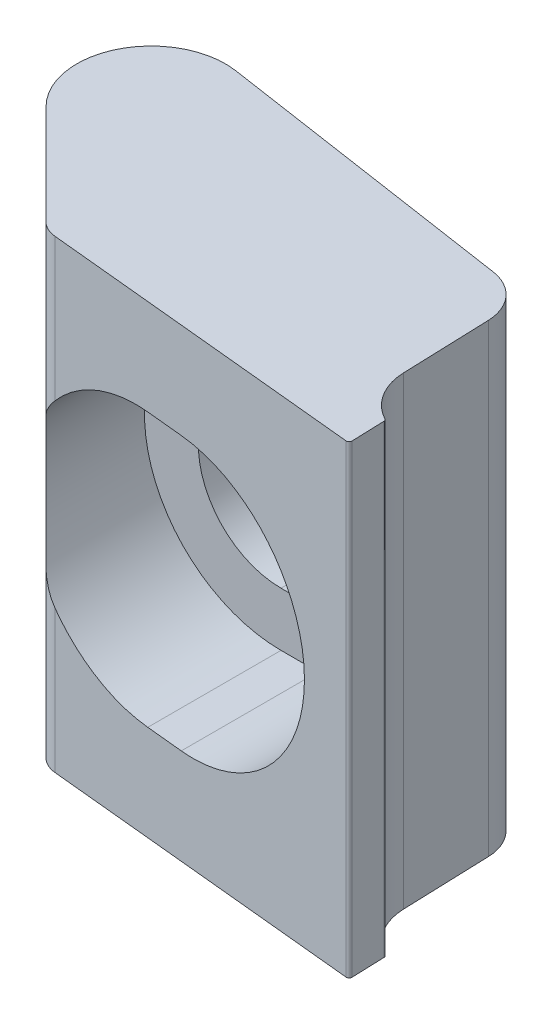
ISO-10303-21;
HEADER;
FILE_DESCRIPTION(('STEP AP214'),'2;1');
FILE_NAME('part.step','',(''),(''),'','','');
FILE_SCHEMA(('AUTOMOTIVE_DESIGN { 1 0 10303 214 1 1 1 1 }'));
ENDSEC;
DATA;
#1=APPLICATION_CONTEXT('core data for automotive mechanical design processes');
#2=APPLICATION_PROTOCOL_DEFINITION('international standard','automotive_design',2000,#1);
#3=PRODUCT_CONTEXT('',#1,'mechanical');
#4=PRODUCT('Part','Part','',(#3));
#5=PRODUCT_RELATED_PRODUCT_CATEGORY('part','',(#4));
#6=PRODUCT_DEFINITION_FORMATION('','',#4);
#7=PRODUCT_DEFINITION_CONTEXT('part definition',#1,'design');
#8=PRODUCT_DEFINITION('design','',#6,#7);
#9=PRODUCT_DEFINITION_SHAPE('','',#8);
#10=(LENGTH_UNIT() NAMED_UNIT(*) SI_UNIT(.MILLI.,.METRE.));
#11=(NAMED_UNIT(*) PLANE_ANGLE_UNIT() SI_UNIT($,.RADIAN.));
#12=(NAMED_UNIT(*) SI_UNIT($,.STERADIAN.) SOLID_ANGLE_UNIT());
#13=UNCERTAINTY_MEASURE_WITH_UNIT(LENGTH_MEASURE(1.E-05),#10,'distance_accuracy_value','');
#14=(GEOMETRIC_REPRESENTATION_CONTEXT(3) GLOBAL_UNCERTAINTY_ASSIGNED_CONTEXT((#13)) GLOBAL_UNIT_ASSIGNED_CONTEXT((#10,
#11,#12)) REPRESENTATION_CONTEXT('',''));
#15=CARTESIAN_POINT('',(0.,0.,0.));
#16=DIRECTION('',(0.,0.,1.));
#17=DIRECTION('',(1.,0.,0.));
#18=AXIS2_PLACEMENT_3D('',#15,#16,#17);
#19=CARTESIAN_POINT('',(-5.63321148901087,9.525,8.4857853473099));
#20=DIRECTION('',(0.,-1.,0.));
#21=DIRECTION('',(1.,0.,0.));
#22=AXIS2_PLACEMENT_3D('',#19,#20,#21);
#23=CYLINDRICAL_SURFACE('',#22,1.143);
#24=DIRECTION('',(0.,-1.,0.));
#25=VECTOR('',#24,1.);
#26=CARTESIAN_POINT('',(-6.44143453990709,9.525,9.29400839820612));
#27=LINE('',#26,#25);
#28=CARTESIAN_POINT('',(-6.44143453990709,9.525,9.29400839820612));
#29=VERTEX_POINT('',#28);
#30=CARTESIAN_POINT('',(-6.44143453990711,2.68079802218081,9.29400839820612));
#31=VERTEX_POINT('',#30);
#32=EDGE_CURVE('E327',#29,#31,#27,.T.);
#33=ORIENTED_EDGE('',*,*,#32,.T.);
#34=CARTESIAN_POINT('',(-4.49021148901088,4.75072940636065,8.4857853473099));
#35=CARTESIAN_POINT('',(-4.49021469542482,4.75072833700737,8.42949001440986));
#36=CARTESIAN_POINT('',(-4.49439454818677,4.74812553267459,8.3731533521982));
#37=CARTESIAN_POINT('',(-4.51089792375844,4.73776021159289,8.26213643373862));
#38=CARTESIAN_POINT('',(-4.52323094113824,4.72999167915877,8.20745818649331));
#39=CARTESIAN_POINT('',(-4.55533502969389,4.7094805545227,8.10148309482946));
#40=CARTESIAN_POINT('',(-4.57508705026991,4.6967506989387,8.05017798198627));
#41=CARTESIAN_POINT('',(-4.62102342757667,4.66658735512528,7.95206193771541));
#42=CARTESIAN_POINT('',(-4.64720715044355,4.6491543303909,7.90525056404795));
#43=CARTESIAN_POINT('',(-4.70591191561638,4.60918444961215,7.81529323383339));
#44=CARTESIAN_POINT('',(-4.73863845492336,4.58647665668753,7.77235832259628));
#45=CARTESIAN_POINT('',(-4.80830188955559,4.53685258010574,7.69283410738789));
#46=CARTESIAN_POINT('',(-4.8452401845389,4.50993489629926,7.65624692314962));
#47=CARTESIAN_POINT('',(-4.9269283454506,4.44868974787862,7.58528258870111));
#48=CARTESIAN_POINT('',(-4.97207122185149,4.41385436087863,7.55179932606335));
#49=CARTESIAN_POINT('',(-5.06431471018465,4.34022035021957,7.49290736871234));
#50=CARTESIAN_POINT('',(-5.11141662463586,4.30141906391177,7.46750414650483));
#51=CARTESIAN_POINT('',(-5.23147826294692,4.19898852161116,7.41273697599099));
#52=CARTESIAN_POINT('',(-5.30486740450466,4.13312974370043,7.38845180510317));
#53=CARTESIAN_POINT('',(-5.44979945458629,3.995747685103,7.35513734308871));
#54=CARTESIAN_POINT('',(-5.5213376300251,3.92421148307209,7.34614396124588));
#55=CARTESIAN_POINT('',(-5.6881100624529,3.74805667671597,7.33997003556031));
#56=CARTESIAN_POINT('',(-5.78153990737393,3.64153383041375,7.34886026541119));
#57=CARTESIAN_POINT('',(-5.95848782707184,3.4238759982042,7.38630827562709));
#58=CARTESIAN_POINT('',(-6.04199262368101,3.31273509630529,7.41489206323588));
#59=CARTESIAN_POINT('',(-6.16039883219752,3.14271287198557,7.47064964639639));
#60=CARTESIAN_POINT('',(-6.19928710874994,3.08453155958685,7.49182979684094));
#61=CARTESIAN_POINT('',(-6.27413970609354,2.96796307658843,7.5383656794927));
#62=CARTESIAN_POINT('',(-6.31010466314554,2.90957595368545,7.56372049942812));
#63=CARTESIAN_POINT('',(-6.37910161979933,2.7929237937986,7.61858116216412));
#64=CARTESIAN_POINT('',(-6.41213062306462,2.73465893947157,7.64809116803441));
#65=CARTESIAN_POINT('',(-6.47512508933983,2.61888278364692,7.71143199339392));
#66=CARTESIAN_POINT('',(-6.50509223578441,2.56137108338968,7.74526041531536));
#67=CARTESIAN_POINT('',(-6.56638912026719,2.43875650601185,7.8235915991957));
#68=CARTESIAN_POINT('',(-6.59717682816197,2.37390200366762,7.86893635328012));
#69=CARTESIAN_POINT('',(-6.63964580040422,2.28017353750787,7.94325437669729));
#70=CARTESIAN_POINT('',(-6.65315959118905,2.24958163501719,7.96901837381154));
#71=CARTESIAN_POINT('',(-6.67881238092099,2.19015737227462,8.02311199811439));
#72=CARTESIAN_POINT('',(-6.69095288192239,2.16132310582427,8.05143875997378));
#73=CARTESIAN_POINT('',(-6.71077901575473,2.11321201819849,8.10385033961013));
#74=CARTESIAN_POINT('',(-6.71882286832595,2.09333806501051,8.12724558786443));
#75=CARTESIAN_POINT('',(-6.7337834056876,2.0558221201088,8.17619443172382));
#76=CARTESIAN_POINT('',(-6.74069839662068,2.03818349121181,8.20175118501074));
#77=CARTESIAN_POINT('',(-6.75314803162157,2.00602896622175,8.25563964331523));
#78=CARTESIAN_POINT('',(-6.75866201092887,1.99156021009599,8.28400516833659));
#79=CARTESIAN_POINT('',(-6.76765888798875,1.96775198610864,8.34309859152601));
#80=CARTESIAN_POINT('',(-6.77114994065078,1.95839193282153,8.37381643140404));
#81=CARTESIAN_POINT('',(-6.77495968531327,1.94814870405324,8.42774084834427));
#82=CARTESIAN_POINT('',(-6.77589966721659,1.94560795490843,8.45058690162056));
#83=CARTESIAN_POINT('',(-6.77639118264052,1.94428095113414,8.49640589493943));
#84=CARTESIAN_POINT('',(-6.77594303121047,1.94549384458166,8.5193788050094));
#85=CARTESIAN_POINT('',(-6.77371059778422,1.95150923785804,8.56468096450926));
#86=CARTESIAN_POINT('',(-6.77193112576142,1.95629881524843,8.58701223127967));
#87=CARTESIAN_POINT('',(-6.76720615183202,1.96892736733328,8.63065948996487));
#88=CARTESIAN_POINT('',(-6.76425949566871,1.97676936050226,8.65197445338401));
#89=CARTESIAN_POINT('',(-6.75514560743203,2.00080201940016,8.70697018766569));
#90=CARTESIAN_POINT('',(-6.74813407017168,2.01909369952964,8.73958211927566));
#91=CARTESIAN_POINT('',(-6.73219451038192,2.05986233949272,8.80156563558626));
#92=CARTESIAN_POINT('',(-6.72325966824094,2.08235415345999,8.83092511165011));
#93=CARTESIAN_POINT('',(-6.70376213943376,2.13039655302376,8.88737774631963));
#94=CARTESIAN_POINT('',(-6.69317265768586,2.15599557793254,8.9144196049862));
#95=CARTESIAN_POINT('',(-6.670752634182,2.20898407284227,8.96615056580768));
#96=CARTESIAN_POINT('',(-6.65892079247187,2.2363754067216,8.99083715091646));
#97=CARTESIAN_POINT('',(-6.621767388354,2.32041919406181,9.06206003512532));
#98=CARTESIAN_POINT('',(-6.59482686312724,2.37884384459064,9.10565429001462));
#99=CARTESIAN_POINT('',(-6.53604153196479,2.50041196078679,9.1886569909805));
#100=CARTESIAN_POINT('',(-6.50403556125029,2.56365029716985,9.22780455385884));
#101=CARTESIAN_POINT('',(-6.43623617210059,2.69128280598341,9.3006946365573));
#102=CARTESIAN_POINT('',(-6.40043930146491,2.75567798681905,9.33443215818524));
#103=CARTESIAN_POINT('',(-6.32518499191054,2.88479628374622,9.39683382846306));
#104=CARTESIAN_POINT('',(-6.28572706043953,2.94951944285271,9.42549729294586));
#105=CARTESIAN_POINT('',(-6.20321759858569,3.07874116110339,9.4777143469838));
#106=CARTESIAN_POINT('',(-6.16016532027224,3.14323967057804,9.50126686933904));
#107=CARTESIAN_POINT('',(-6.03710812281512,3.31938624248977,9.55852949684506));
#108=CARTESIAN_POINT('',(-5.95346329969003,3.43037193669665,9.58673960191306));
#109=CARTESIAN_POINT('',(-5.77637875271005,3.64755014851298,9.62336608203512));
#110=CARTESIAN_POINT('',(-5.68296439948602,3.75375410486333,9.63183245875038));
#111=CARTESIAN_POINT('',(-5.51919097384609,3.92628603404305,9.62503834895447));
#112=CARTESIAN_POINT('',(-5.4507621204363,3.99469439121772,9.61637222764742));
#113=CARTESIAN_POINT('',(-5.31211391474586,4.12639234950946,9.585049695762));
#114=CARTESIAN_POINT('',(-5.24189669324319,4.18968769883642,9.56240925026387));
#115=CARTESIAN_POINT('',(-5.11714942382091,4.29679110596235,9.50742685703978));
#116=CARTESIAN_POINT('',(-5.06241466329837,4.34190375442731,9.47811092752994));
#117=CARTESIAN_POINT('',(-4.95572646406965,4.4267047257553,9.40855466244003));
#118=CARTESIAN_POINT('',(-4.90376966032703,4.46639970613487,9.36832791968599));
#119=CARTESIAN_POINT('',(-4.81354641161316,4.53313823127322,9.28437004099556));
#120=CARTESIAN_POINT('',(-4.77444211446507,4.56118760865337,9.24234330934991));
#121=CARTESIAN_POINT('',(-4.70181412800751,4.61208245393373,9.15088102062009));
#122=CARTESIAN_POINT('',(-4.6682905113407,4.63492785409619,9.10144536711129));
#123=CARTESIAN_POINT('',(-4.6084950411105,4.67493748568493,8.99579804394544));
#124=CARTESIAN_POINT('',(-4.58226962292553,4.69206547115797,8.93954611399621));
#125=CARTESIAN_POINT('',(-4.53905343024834,4.719953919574,8.82217796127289));
#126=CARTESIAN_POINT('',(-4.52204580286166,4.73072600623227,8.76107085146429));
#127=CARTESIAN_POINT('',(-4.5035867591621,4.74235789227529,8.6637390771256));
#128=CARTESIAN_POINT('',(-4.4985829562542,4.74549386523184,8.62841295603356));
#129=CARTESIAN_POINT('',(-4.49189443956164,4.74967987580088,8.55732521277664));
#130=CARTESIAN_POINT('',(-4.490209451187,4.75073008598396,8.52156362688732));
#131=CARTESIAN_POINT('',(-4.49021148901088,4.75072940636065,8.4857853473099));
#132=B_SPLINE_CURVE_WITH_KNOTS('',3,(#34,#35,#36,#37,#38,#39,#40,#41,#42,#43,#44,#45,#46,#47,
#48,#49,#50,#51,#52,#53,#54,#55,#56,#57,#58,#59,#60,#61,#62,#63,#64,#65,#66,#67,#68,#69,#70,#71,
#72,#73,#74,#75,#76,#77,#78,#79,#80,#81,#82,#83,#84,#85,#86,#87,#88,#89,#90,#91,#92,#93,#94,#95,
#96,#97,#98,#99,#100,#101,#102,#103,#104,#105,#106,#107,#108,#109,#110,#111,#112,#113,#114,#115,
#116,#117,#118,#119,#120,#121,#122,#123,#124,#125,#126,#127,#128,#129,#130,#131),.UNSPECIFIED.,
.T.,.F.,(4,2,2,2,2,2,2,2,2,2,2,2,2,2,2,2,2,2,2,2,2,2,2,2,2,2,2,2,2,2,2,2,2,2,2,2,2,2,2,2,2,2,2,
2,2,2,2,2,4),(0.,0.168746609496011,0.33769007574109,0.50620266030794,0.674698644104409,
0.849694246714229,1.02474817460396,1.22238324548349,1.42015188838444,1.72310054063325,
2.02675962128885,2.45038828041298,2.8745774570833,3.09377987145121,3.31293444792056,
3.53231017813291,3.75156463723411,4.00570961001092,4.13226772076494,4.25868604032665,
4.35376083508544,4.44897700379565,4.54552526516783,4.64168155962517,4.71037401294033,
4.77905087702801,4.84748080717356,4.9159785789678,5.02944692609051,5.14332443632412,
5.25928570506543,5.37536954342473,5.60797929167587,5.85059968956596,6.09344296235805,
6.33631895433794,6.57924561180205,7.00310547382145,7.42589072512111,7.71640614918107,
8.00659028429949,8.2359829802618,8.46509119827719,8.65597505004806,8.84686138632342,
9.03893584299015,9.23065793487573,9.33791305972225,9.44515931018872),.UNSPECIFIED.);
#133=CARTESIAN_POINT('',(-5.74474874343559,3.68145630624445,9.62333026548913));
#134=VERTEX_POINT('',#133);
#135=EDGE_CURVE('E212',#31,#134,#132,.T.);
#136=ORIENTED_EDGE('',*,*,#135,.T.);
#137=DIRECTION('',(0.,-1.,0.));
#138=VECTOR('',#137,1.);
#139=CARTESIAN_POINT('',(-5.74474874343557,9.525,9.62333026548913));
#140=LINE('',#139,#138);
#141=CARTESIAN_POINT('',(-5.74474874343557,9.525,9.62333026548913));
#142=VERTEX_POINT('',#141);
#143=EDGE_CURVE('E323',#142,#134,#140,.T.);
#144=ORIENTED_EDGE('',*,*,#143,.F.);
#145=CARTESIAN_POINT('',(-5.63321148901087,9.525,8.4857853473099));
#146=DIRECTION('',(0.,1.,0.));
#147=DIRECTION('',(1.,0.,0.));
#148=AXIS2_PLACEMENT_3D('',#145,#146,#147);
#149=CIRCLE('',#148,1.143);
#150=EDGE_CURVE('E280',#29,#142,#149,.T.);
#151=ORIENTED_EDGE('',*,*,#150,.F.);
#152=EDGE_LOOP('',(#33,#136,#144,#151));
#153=FACE_BOUND('',#152,.T.);
#154=ADVANCED_FACE('F16',(#153),#23,.T.);
#155=CARTESIAN_POINT('',(-8.37692,9.525,3.048));
#156=DIRECTION('',(0.,-1.,0.));
#157=DIRECTION('',(1.,0.,0.));
#158=AXIS2_PLACEMENT_3D('',#155,#156,#157);
#159=CYLINDRICAL_SURFACE('',#158,3.048);
#160=CARTESIAN_POINT('',(-8.37692,-9.525,3.048));
#161=DIRECTION('',(0.,1.,0.));
#162=DIRECTION('',(-1.,0.,0.));
#163=AXIS2_PLACEMENT_3D('',#160,#161,#162);
#164=CIRCLE('',#163,3.048);
#165=CARTESIAN_POINT('',(-7.92431353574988,-9.525,0.0337917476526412));
#166=VERTEX_POINT('',#165);
#167=CARTESIAN_POINT('',(-10.5321814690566,-9.525,5.20326146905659));
#168=VERTEX_POINT('',#167);
#169=EDGE_CURVE('E250',#166,#168,#164,.T.);
#170=ORIENTED_EDGE('',*,*,#169,.T.);
#171=DIRECTION('',(0.,-1.,0.));
#172=VECTOR('',#171,1.);
#173=CARTESIAN_POINT('',(-10.5321814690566,9.525,5.20326146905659));
#174=LINE('',#173,#172);
#175=CARTESIAN_POINT('',(-10.5321814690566,9.525,5.20326146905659));
#176=VERTEX_POINT('',#175);
#177=EDGE_CURVE('E330',#176,#168,#174,.T.);
#178=ORIENTED_EDGE('',*,*,#177,.F.);
#179=CARTESIAN_POINT('',(-8.37692,9.525,3.048));
#180=DIRECTION('',(0.,1.,0.));
#181=DIRECTION('',(-1.,0.,0.));
#182=AXIS2_PLACEMENT_3D('',#179,#180,#181);
#183=CIRCLE('',#182,3.048);
#184=CARTESIAN_POINT('',(-7.92431353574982,9.525,0.0337917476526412));
#185=VERTEX_POINT('',#184);
#186=EDGE_CURVE('E275',#185,#176,#183,.T.);
#187=ORIENTED_EDGE('',*,*,#186,.F.);
#188=DIRECTION('',(0.,-1.,0.));
#189=VECTOR('',#188,1.);
#190=CARTESIAN_POINT('',(-7.92431353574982,9.525,0.0337917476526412));
#191=LINE('',#190,#189);
#192=EDGE_CURVE('E298',#185,#166,#191,.T.);
#193=ORIENTED_EDGE('',*,*,#192,.T.);
#194=EDGE_LOOP('',(#170,#178,#187,#193));
#195=FACE_BOUND('',#194,.T.);
#196=ADVANCED_FACE('F18',(#195),#159,.T.);
#197=CARTESIAN_POINT('',(-6.44143453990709,9.525,9.29400839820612));
#198=DIRECTION('',(0.707106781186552,0.,-0.707106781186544));
#199=DIRECTION('',(-0.707106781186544,0.,-0.707106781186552));
#200=AXIS2_PLACEMENT_3D('',#197,#198,#199);
#201=PLANE('',#200);
#202=CARTESIAN_POINT('',(-6.44143453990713,-2.68079802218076,9.29400839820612));
#203=VERTEX_POINT('',#202);
#204=CARTESIAN_POINT('',(-6.44143453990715,-9.525,9.29400839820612));
#205=VERTEX_POINT('',#204);
#206=EDGE_CURVE('E326',#203,#205,#27,.T.);
#207=ORIENTED_EDGE('',*,*,#206,.F.);
#208=CARTESIAN_POINT('',(-1.524,0.,14.2114429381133));
#209=DIRECTION('',(0.707106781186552,0.,-0.707106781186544));
#210=DIRECTION('',(0.707106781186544,0.,0.707106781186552));
#211=AXIS2_PLACEMENT_3D('',#208,#209,#210);
#212=ELLIPSE('',#211,7.92058589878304,5.6007);
#213=EDGE_CURVE('E227',#203,#31,#212,.T.);
#214=ORIENTED_EDGE('',*,*,#213,.T.);
#215=ORIENTED_EDGE('',*,*,#32,.F.);
#216=DIRECTION('',(0.707106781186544,0.,0.707106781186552));
#217=VECTOR('',#216,1.);
#218=CARTESIAN_POINT('',(-6.44143453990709,9.525,9.29400839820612));
#219=LINE('',#218,#217);
#220=EDGE_CURVE('E278',#176,#29,#219,.T.);
#221=ORIENTED_EDGE('',*,*,#220,.F.);
#222=ORIENTED_EDGE('',*,*,#177,.T.);
#223=DIRECTION('',(0.707106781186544,0.,0.707106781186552));
#224=VECTOR('',#223,1.);
#225=CARTESIAN_POINT('',(-6.44143453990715,-9.525,9.29400839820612));
#226=LINE('',#225,#224);
#227=EDGE_CURVE('E253',#168,#205,#226,.T.);
#228=ORIENTED_EDGE('',*,*,#227,.T.);
#229=EDGE_LOOP('',(#207,#214,#215,#221,#222,#228));
#230=FACE_BOUND('',#229,.T.);
#231=ADVANCED_FACE('F352',(#230),#201,.F.);
#232=CARTESIAN_POINT('',(-5.74474874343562,-3.6814563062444,9.62333026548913));
#233=VERTEX_POINT('',#232);
#234=CARTESIAN_POINT('',(-5.74474874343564,-9.525,9.62333026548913));
#235=VERTEX_POINT('',#234);
#236=EDGE_CURVE('E322',#233,#235,#140,.T.);
#237=ORIENTED_EDGE('',*,*,#236,.F.);
#238=CARTESIAN_POINT('',(-4.49021148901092,-4.75072940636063,8.4857853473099));
#239=CARTESIAN_POINT('',(-4.49021469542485,-4.75072833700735,8.54208068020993));
#240=CARTESIAN_POINT('',(-4.49439454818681,-4.74812553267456,8.59841734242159));
#241=CARTESIAN_POINT('',(-4.51089792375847,-4.73776021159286,8.70943426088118));
#242=CARTESIAN_POINT('',(-4.52323094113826,-4.72999167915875,8.76411250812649));
#243=CARTESIAN_POINT('',(-4.55533502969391,-4.70948055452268,8.87008759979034));
#244=CARTESIAN_POINT('',(-4.57508705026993,-4.69675069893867,8.92139271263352));
#245=CARTESIAN_POINT('',(-4.6210234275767,-4.66658735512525,9.01950875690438));
#246=CARTESIAN_POINT('',(-4.64720715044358,-4.64915433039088,9.06632013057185));
#247=CARTESIAN_POINT('',(-4.70591191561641,-4.60918444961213,9.15627746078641));
#248=CARTESIAN_POINT('',(-4.73863845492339,-4.58647665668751,9.19921237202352));
#249=CARTESIAN_POINT('',(-4.80830188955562,-4.5368525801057,9.2787365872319));
#250=CARTESIAN_POINT('',(-4.84524018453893,-4.50993489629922,9.31532377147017));
#251=CARTESIAN_POINT('',(-4.92692834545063,-4.44868974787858,9.38628810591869));
#252=CARTESIAN_POINT('',(-4.97207122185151,-4.4138543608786,9.41977136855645));
#253=CARTESIAN_POINT('',(-5.06431471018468,-4.34022035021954,9.47866332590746));
#254=CARTESIAN_POINT('',(-5.1114166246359,-4.30141906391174,9.50406654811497));
#255=CARTESIAN_POINT('',(-5.23147826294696,-4.19898852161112,9.55883371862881));
#256=CARTESIAN_POINT('',(-5.30486740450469,-4.13312974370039,9.58311888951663));
#257=CARTESIAN_POINT('',(-5.44979945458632,-3.99574768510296,9.61643335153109));
#258=CARTESIAN_POINT('',(-5.52133763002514,-3.92421148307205,9.62542673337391));
#259=CARTESIAN_POINT('',(-5.68811006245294,-3.74805667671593,9.63160065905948));
#260=CARTESIAN_POINT('',(-5.78153990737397,-3.6415338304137,9.6227104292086));
#261=CARTESIAN_POINT('',(-5.95848782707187,-3.42387599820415,9.58526241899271));
#262=CARTESIAN_POINT('',(-6.04199262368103,-3.31273509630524,9.55667863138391));
#263=CARTESIAN_POINT('',(-6.16039883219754,-3.14271287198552,9.5009210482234));
#264=CARTESIAN_POINT('',(-6.19928710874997,-3.0845315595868,9.47974089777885));
#265=CARTESIAN_POINT('',(-6.27413970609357,-2.96796307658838,9.43320501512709));
#266=CARTESIAN_POINT('',(-6.31010466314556,-2.9095759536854,9.40785019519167));
#267=CARTESIAN_POINT('',(-6.37910161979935,-2.79292379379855,9.35298953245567));
#268=CARTESIAN_POINT('',(-6.41213062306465,-2.73465893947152,9.32347952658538));
#269=CARTESIAN_POINT('',(-6.47512508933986,-2.61888278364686,9.26013870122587));
#270=CARTESIAN_POINT('',(-6.50509223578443,-2.56137108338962,9.22631027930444));
#271=CARTESIAN_POINT('',(-6.56638912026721,-2.43875650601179,9.14797909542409));
#272=CARTESIAN_POINT('',(-6.597176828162,-2.37390200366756,9.10263434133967));
#273=CARTESIAN_POINT('',(-6.63964580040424,-2.28017353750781,9.02831631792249));
#274=CARTESIAN_POINT('',(-6.65315959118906,-2.24958163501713,9.00255232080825));
#275=CARTESIAN_POINT('',(-6.67881238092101,-2.19015737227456,8.94845869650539));
#276=CARTESIAN_POINT('',(-6.69095288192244,-2.16132310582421,8.920131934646));
#277=CARTESIAN_POINT('',(-6.71077901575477,-2.11321201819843,8.86772035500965));
#278=CARTESIAN_POINT('',(-6.71882286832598,-2.09333806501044,8.84432510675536));
#279=CARTESIAN_POINT('',(-6.73378340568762,-2.05582212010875,8.79537626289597));
#280=CARTESIAN_POINT('',(-6.7406983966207,-2.03818349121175,8.76981950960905));
#281=CARTESIAN_POINT('',(-6.75314803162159,-2.0060289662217,8.71593105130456));
#282=CARTESIAN_POINT('',(-6.75866201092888,-1.99156021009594,8.68756552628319));
#283=CARTESIAN_POINT('',(-6.76765888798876,-1.96775198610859,8.62847210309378));
#284=CARTESIAN_POINT('',(-6.77114994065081,-1.95839193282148,8.59775426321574));
#285=CARTESIAN_POINT('',(-6.77495968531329,-1.94814870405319,8.54382984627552));
#286=CARTESIAN_POINT('',(-6.77589966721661,-1.94560795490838,8.52098379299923));
#287=CARTESIAN_POINT('',(-6.77639118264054,-1.94428095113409,8.47516479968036));
#288=CARTESIAN_POINT('',(-6.77594303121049,-1.94549384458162,8.45219188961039));
#289=CARTESIAN_POINT('',(-6.77371059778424,-1.951509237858,8.40688973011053));
#290=CARTESIAN_POINT('',(-6.77193112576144,-1.95629881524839,8.38455846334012));
#291=CARTESIAN_POINT('',(-6.76720615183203,-1.96892736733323,8.34091120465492));
#292=CARTESIAN_POINT('',(-6.76425949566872,-1.97676936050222,8.31959624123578));
#293=CARTESIAN_POINT('',(-6.75514560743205,-2.00080201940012,8.2646005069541));
#294=CARTESIAN_POINT('',(-6.7481340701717,-2.0190936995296,8.23198857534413));
#295=CARTESIAN_POINT('',(-6.73219451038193,-2.05986233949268,8.17000505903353));
#296=CARTESIAN_POINT('',(-6.72325966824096,-2.08235415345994,8.14064558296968));
#297=CARTESIAN_POINT('',(-6.70376213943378,-2.13039655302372,8.08419294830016));
#298=CARTESIAN_POINT('',(-6.69317265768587,-2.1559955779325,8.05715108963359));
#299=CARTESIAN_POINT('',(-6.67075263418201,-2.20898407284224,8.00542012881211));
#300=CARTESIAN_POINT('',(-6.65892079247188,-2.23637540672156,7.98073354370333));
#301=CARTESIAN_POINT('',(-6.62176738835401,-2.32041919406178,7.90951065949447));
#302=CARTESIAN_POINT('',(-6.59482686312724,-2.3788438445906,7.86591640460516));
#303=CARTESIAN_POINT('',(-6.53604153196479,-2.50041196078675,7.78291370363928));
#304=CARTESIAN_POINT('',(-6.5040355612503,-2.56365029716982,7.74376614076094));
#305=CARTESIAN_POINT('',(-6.4362361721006,-2.69128280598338,7.6708760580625));
#306=CARTESIAN_POINT('',(-6.40043930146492,-2.75567798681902,7.63713853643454));
#307=CARTESIAN_POINT('',(-6.32518499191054,-2.88479628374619,7.57473686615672));
#308=CARTESIAN_POINT('',(-6.28572706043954,-2.94951944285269,7.54607340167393));
#309=CARTESIAN_POINT('',(-6.2032175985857,-3.07874116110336,7.49385634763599));
#310=CARTESIAN_POINT('',(-6.16016532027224,-3.14323967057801,7.47030382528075));
#311=CARTESIAN_POINT('',(-6.03710812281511,-3.31938624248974,7.41304119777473));
#312=CARTESIAN_POINT('',(-5.95346329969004,-3.43037193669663,7.38483109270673));
#313=CARTESIAN_POINT('',(-5.77637875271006,-3.64755014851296,7.34820461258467));
#314=CARTESIAN_POINT('',(-5.68296439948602,-3.7537541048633,7.3397382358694));
#315=CARTESIAN_POINT('',(-5.51919097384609,-3.92628603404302,7.34653234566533));
#316=CARTESIAN_POINT('',(-5.45076212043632,-3.99469439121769,7.35519846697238));
#317=CARTESIAN_POINT('',(-5.31211391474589,-4.12639234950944,7.3865209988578));
#318=CARTESIAN_POINT('',(-5.24189669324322,-4.18968769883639,7.40916144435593));
#319=CARTESIAN_POINT('',(-5.11714942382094,-4.29679110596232,7.46414383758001));
#320=CARTESIAN_POINT('',(-5.06241466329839,-4.34190375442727,7.49345976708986));
#321=CARTESIAN_POINT('',(-4.95572646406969,-4.42670472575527,7.56301603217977));
#322=CARTESIAN_POINT('',(-4.90376966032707,-4.46639970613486,7.60324277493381));
#323=CARTESIAN_POINT('',(-4.8135464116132,-4.53313823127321,7.68720065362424));
#324=CARTESIAN_POINT('',(-4.7744421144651,-4.56118760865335,7.72922738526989));
#325=CARTESIAN_POINT('',(-4.70181412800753,-4.6120824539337,7.82068967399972));
#326=CARTESIAN_POINT('',(-4.66829051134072,-4.63492785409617,7.87012532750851));
#327=CARTESIAN_POINT('',(-4.60849504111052,-4.67493748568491,7.97577265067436));
#328=CARTESIAN_POINT('',(-4.58226962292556,-4.69206547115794,8.03202458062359));
#329=CARTESIAN_POINT('',(-4.53905343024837,-4.71995391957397,8.14939273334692));
#330=CARTESIAN_POINT('',(-4.52204580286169,-4.73072600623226,8.21049984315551));
#331=CARTESIAN_POINT('',(-4.50358675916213,-4.74235789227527,8.3078316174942));
#332=CARTESIAN_POINT('',(-4.49858295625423,-4.74549386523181,8.34315773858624));
#333=CARTESIAN_POINT('',(-4.49189443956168,-4.74967987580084,8.41424548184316));
#334=CARTESIAN_POINT('',(-4.49020945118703,-4.75073008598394,8.45000706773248));
#335=CARTESIAN_POINT('',(-4.49021148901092,-4.75072940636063,8.4857853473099));
#336=B_SPLINE_CURVE_WITH_KNOTS('',3,(#238,#239,#240,#241,#242,#243,#244,#245,#246,#247,#248,
#249,#250,#251,#252,#253,#254,#255,#256,#257,#258,#259,#260,#261,#262,#263,#264,#265,#266,#267,
#268,#269,#270,#271,#272,#273,#274,#275,#276,#277,#278,#279,#280,#281,#282,#283,#284,#285,#286,
#287,#288,#289,#290,#291,#292,#293,#294,#295,#296,#297,#298,#299,#300,#301,#302,#303,#304,#305,
#306,#307,#308,#309,#310,#311,#312,#313,#314,#315,#316,#317,#318,#319,#320,#321,#322,#323,#324,
#325,#326,#327,#328,#329,#330,#331,#332,#333,#334,#335),.UNSPECIFIED.,.T.,.F.,(4,2,2,2,2,2,2,2,
2,2,2,2,2,2,2,2,2,2,2,2,2,2,2,2,2,2,2,2,2,2,2,2,2,2,2,2,2,2,2,2,2,2,2,2,2,2,2,2,4),(0.,
0.168746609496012,0.337690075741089,0.506202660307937,0.674698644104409,0.849694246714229,
1.02474817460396,1.22238324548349,1.42015188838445,1.72310054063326,2.02675962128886,
2.45038828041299,2.87457745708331,3.09377987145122,3.31293444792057,3.53231017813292,
3.75156463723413,4.00570961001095,4.13226772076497,4.25868604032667,4.35376083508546,
4.44897700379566,4.54552526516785,4.64168155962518,4.71037401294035,4.77905087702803,
4.84748080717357,4.91597857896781,5.02944692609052,5.14332443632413,5.25928570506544,
5.37536954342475,5.6079792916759,5.85059968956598,6.09344296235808,6.33631895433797,
6.57924561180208,7.00310547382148,7.42589072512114,7.71640614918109,8.00659028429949,
8.23598298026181,8.4650911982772,8.65597505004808,8.84686138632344,9.03893584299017,
9.23065793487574,9.33791305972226,9.44515931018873),.UNSPECIFIED.);
#337=EDGE_CURVE('E244',#233,#203,#336,.T.);
#338=ORIENTED_EDGE('',*,*,#337,.T.);
#339=ORIENTED_EDGE('',*,*,#206,.T.);
#340=CARTESIAN_POINT('',(-5.63321148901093,-9.525,8.4857853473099));
#341=DIRECTION('',(0.,1.,0.));
#342=DIRECTION('',(1.,0.,0.));
#343=AXIS2_PLACEMENT_3D('',#340,#341,#342);
#344=CIRCLE('',#343,1.143);
#345=EDGE_CURVE('E256',#205,#235,#344,.T.);
#346=ORIENTED_EDGE('',*,*,#345,.T.);
#347=EDGE_LOOP('',(#237,#338,#339,#346));
#348=FACE_BOUND('',#347,.T.);
#349=ADVANCED_FACE('F229',(#348),#23,.T.);
#350=CARTESIAN_POINT('',(7.49454627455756,9.525,10.9214544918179));
#351=DIRECTION('',(0.0975828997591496,0.,-0.995227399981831));
#352=DIRECTION('',(-0.995227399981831,0.,-0.0975828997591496));
#353=AXIS2_PLACEMENT_3D('',#350,#351,#352);
#354=PLANE('',#353);
#355=DIRECTION('',(-0.995227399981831,0.,-0.0975828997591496));
#356=VECTOR('',#355,1.);
#357=CARTESIAN_POINT('',(7.49454627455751,-5.6007,10.9214544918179));
#358=LINE('',#357,#356);
#359=CARTESIAN_POINT('',(0.,-5.6007,10.186607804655));
#360=VERTEX_POINT('',#359);
#361=CARTESIAN_POINT('',(-1.524,-5.6007,10.0371782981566));
#362=VERTEX_POINT('',#361);
#363=EDGE_CURVE('E333',#360,#362,#358,.T.);
#364=ORIENTED_EDGE('',*,*,#363,.T.);
#365=CARTESIAN_POINT('',(-1.524,0.,10.0371782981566));
#366=DIRECTION('',(0.0975828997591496,0.,-0.995227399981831));
#367=DIRECTION('',(0.995227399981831,0.,0.0975828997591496));
#368=AXIS2_PLACEMENT_3D('',#365,#366,#367);
#369=ELLIPSE('',#368,5.62755808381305,5.6007);
#370=EDGE_CURVE('E11',#362,#233,#369,.T.);
#371=ORIENTED_EDGE('',*,*,#370,.T.);
#372=ORIENTED_EDGE('',*,*,#236,.T.);
#373=DIRECTION('',(0.995227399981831,0.,0.0975828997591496));
#374=VECTOR('',#373,1.);
#375=CARTESIAN_POINT('',(7.4945462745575,-9.525,10.9214544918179));
#376=LINE('',#375,#374);
#377=CARTESIAN_POINT('',(7.4945462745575,-9.525,10.9214544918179));
#378=VERTEX_POINT('',#377);
#379=EDGE_CURVE('E259',#235,#378,#376,.T.);
#380=ORIENTED_EDGE('',*,*,#379,.T.);
#381=DIRECTION('',(0.,-1.,0.));
#382=VECTOR('',#381,1.);
#383=CARTESIAN_POINT('',(7.49454627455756,9.525,10.9214544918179));
#384=LINE('',#383,#382);
#385=CARTESIAN_POINT('',(7.49454627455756,9.525,10.9214544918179));
#386=VERTEX_POINT('',#385);
#387=EDGE_CURVE('E319',#386,#378,#384,.T.);
#388=ORIENTED_EDGE('',*,*,#387,.F.);
#389=DIRECTION('',(0.995227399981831,0.,0.0975828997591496));
#390=VECTOR('',#389,1.);
#391=CARTESIAN_POINT('',(7.49454627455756,9.525,10.9214544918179));
#392=LINE('',#391,#390);
#393=EDGE_CURVE('E282',#142,#386,#392,.T.);
#394=ORIENTED_EDGE('',*,*,#393,.F.);
#395=ORIENTED_EDGE('',*,*,#143,.T.);
#396=CARTESIAN_POINT('',(-1.524,5.6007,10.0371782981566));
#397=VERTEX_POINT('',#396);
#398=EDGE_CURVE('E20',#134,#397,#369,.T.);
#399=ORIENTED_EDGE('',*,*,#398,.T.);
#400=DIRECTION('',(0.995227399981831,0.,0.0975828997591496));
#401=VECTOR('',#400,1.);
#402=CARTESIAN_POINT('',(7.49454627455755,5.6007,10.9214544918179));
#403=LINE('',#402,#401);
#404=CARTESIAN_POINT('',(0.,5.6007,10.186607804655));
#405=VERTEX_POINT('',#404);
#406=EDGE_CURVE('E338',#397,#405,#403,.T.);
#407=ORIENTED_EDGE('',*,*,#406,.T.);
#408=CARTESIAN_POINT('',(0.,0.,10.186607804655));
#409=DIRECTION('',(0.0975828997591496,0.,-0.995227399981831));
#410=DIRECTION('',(0.995227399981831,0.,0.0975828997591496));
#411=AXIS2_PLACEMENT_3D('',#408,#409,#410);
#412=ELLIPSE('',#411,5.62755808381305,5.6007);
#413=EDGE_CURVE('E336',#405,#360,#412,.T.);
#414=ORIENTED_EDGE('',*,*,#413,.T.);
#415=EDGE_LOOP('',(#364,#371,#372,#380,#388,#394,#395,#399,#407,#414));
#416=FACE_BOUND('',#415,.T.);
#417=ADVANCED_FACE('F342',(#416),#354,.F.);
#418=CARTESIAN_POINT('',(7.5057,9.525,10.8077));
#419=DIRECTION('',(0.,-1.,0.));
#420=DIRECTION('',(1.,0.,0.));
#421=AXIS2_PLACEMENT_3D('',#418,#419,#420);
#422=CYLINDRICAL_SURFACE('',#421,0.1143);
#423=CARTESIAN_POINT('',(7.5057,-9.525,10.8077));
#424=DIRECTION('',(0.,1.,0.));
#425=DIRECTION('',(-1.,0.,0.));
#426=AXIS2_PLACEMENT_3D('',#423,#424,#425);
#427=CIRCLE('',#426,0.1143);
#428=CARTESIAN_POINT('',(7.61993037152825,-9.525,10.8037109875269));
#429=VERTEX_POINT('',#428);
#430=EDGE_CURVE('E261',#378,#429,#427,.T.);
#431=ORIENTED_EDGE('',*,*,#430,.T.);
#432=DIRECTION('',(0.,-1.,0.));
#433=VECTOR('',#432,1.);
#434=CARTESIAN_POINT('',(7.61993037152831,9.525,10.8037109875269));
#435=LINE('',#434,#433);
#436=CARTESIAN_POINT('',(7.61993037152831,9.525,10.8037109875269));
#437=VERTEX_POINT('',#436);
#438=EDGE_CURVE('E316',#437,#429,#435,.T.);
#439=ORIENTED_EDGE('',*,*,#438,.F.);
#440=CARTESIAN_POINT('',(7.5057,9.525,10.8077));
#441=DIRECTION('',(0.,1.,0.));
#442=DIRECTION('',(-1.,0.,0.));
#443=AXIS2_PLACEMENT_3D('',#440,#441,#442);
#444=CIRCLE('',#443,0.1143);
#445=EDGE_CURVE('E284',#386,#437,#444,.T.);
#446=ORIENTED_EDGE('',*,*,#445,.F.);
#447=ORIENTED_EDGE('',*,*,#387,.T.);
#448=EDGE_LOOP('',(#431,#439,#446,#447));
#449=FACE_BOUND('',#448,.T.);
#450=ADVANCED_FACE('F386',(#449),#422,.T.);
#451=CARTESIAN_POINT('',(7.61993037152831,9.525,10.8037109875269));
#452=DIRECTION('',(-0.999390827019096,0.,0.0348994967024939));
#453=DIRECTION('',(0.0348994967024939,0.,0.999390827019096));
#454=AXIS2_PLACEMENT_3D('',#451,#452,#453);
#455=PLANE('',#454);
#456=DIRECTION('',(-0.0348994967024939,0.,-0.999390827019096));
#457=VECTOR('',#456,1.);
#458=CARTESIAN_POINT('',(7.61993037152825,-9.525,10.8037109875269));
#459=LINE('',#458,#457);
#460=CARTESIAN_POINT('',(7.57241521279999,-9.525,9.4430548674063));
#461=VERTEX_POINT('',#460);
#462=EDGE_CURVE('E263',#429,#461,#459,.T.);
#463=ORIENTED_EDGE('',*,*,#462,.T.);
#464=DIRECTION('',(0.,-1.,0.));
#465=VECTOR('',#464,1.);
#466=CARTESIAN_POINT('',(7.57241521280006,9.525,9.4430548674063));
#467=LINE('',#466,#465);
#468=CARTESIAN_POINT('',(7.57241521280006,9.525,9.4430548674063));
#469=VERTEX_POINT('',#468);
#470=EDGE_CURVE('E313',#469,#461,#467,.T.);
#471=ORIENTED_EDGE('',*,*,#470,.F.);
#472=DIRECTION('',(-0.0348994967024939,0.,-0.999390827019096));
#473=VECTOR('',#472,1.);
#474=CARTESIAN_POINT('',(7.61993037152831,9.525,10.8037109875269));
#475=LINE('',#474,#473);
#476=EDGE_CURVE('E286',#437,#469,#475,.T.);
#477=ORIENTED_EDGE('',*,*,#476,.F.);
#478=ORIENTED_EDGE('',*,*,#438,.T.);
#479=EDGE_LOOP('',(#463,#471,#477,#478));
#480=FACE_BOUND('',#479,.T.);
#481=ADVANCED_FACE('F491',(#480),#455,.F.);
#482=CARTESIAN_POINT('',(7.45818484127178,9.525,9.4470438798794));
#483=DIRECTION('',(0.,-1.,0.));
#484=DIRECTION('',(1.,0.,0.));
#485=AXIS2_PLACEMENT_3D('',#482,#483,#484);
#486=CYLINDRICAL_SURFACE('',#485,0.1143);
#487=CARTESIAN_POINT('',(7.45818484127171,-9.525,9.4470438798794));
#488=DIRECTION('',(0.,1.,0.));
#489=DIRECTION('',(-1.,0.,0.));
#490=AXIS2_PLACEMENT_3D('',#487,#488,#489);
#491=CIRCLE('',#490,0.1143);
#492=CARTESIAN_POINT('',(7.51220014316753,-9.525,9.34631236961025));
#493=VERTEX_POINT('',#492);
#494=EDGE_CURVE('E265',#461,#493,#491,.T.);
#495=ORIENTED_EDGE('',*,*,#494,.T.);
#496=DIRECTION('',(0.,-1.,0.));
#497=VECTOR('',#496,1.);
#498=CARTESIAN_POINT('',(7.51220014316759,9.525,9.34631236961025));
#499=LINE('',#498,#497);
#500=CARTESIAN_POINT('',(7.51220014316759,9.525,9.34631236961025));
#501=VERTEX_POINT('',#500);
#502=EDGE_CURVE('E310',#501,#493,#499,.T.);
#503=ORIENTED_EDGE('',*,*,#502,.F.);
#504=CARTESIAN_POINT('',(7.45818484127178,9.525,9.4470438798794));
#505=DIRECTION('',(0.,1.,0.));
#506=DIRECTION('',(-1.,0.,0.));
#507=AXIS2_PLACEMENT_3D('',#504,#505,#506);
#508=CIRCLE('',#507,0.1143);
#509=EDGE_CURVE('E288',#469,#501,#508,.T.);
#510=ORIENTED_EDGE('',*,*,#509,.F.);
#511=ORIENTED_EDGE('',*,*,#470,.T.);
#512=EDGE_LOOP('',(#495,#503,#510,#511));
#513=FACE_BOUND('',#512,.T.);
#514=ADVANCED_FACE('F481',(#513),#486,.T.);
#515=CARTESIAN_POINT('',(8.63811910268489,9.525,7.24662));
#516=DIRECTION('',(0.,-1.,0.));
#517=DIRECTION('',(1.,0.,0.));
#518=AXIS2_PLACEMENT_3D('',#515,#516,#517);
#519=CYLINDRICAL_SURFACE('',#518,2.38252);
#520=CARTESIAN_POINT('',(8.63811910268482,-9.525,7.24662));
#521=DIRECTION('',(0.,-1.,0.));
#522=DIRECTION('',(-1.,0.,0.));
#523=AXIS2_PLACEMENT_3D('',#520,#521,#522);
#524=CIRCLE('',#523,2.38252);
#525=CARTESIAN_POINT('',(6.25705046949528,-9.525,7.32976874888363));
#526=VERTEX_POINT('',#525);
#527=EDGE_CURVE('E267',#493,#526,#524,.T.);
#528=ORIENTED_EDGE('',*,*,#527,.T.);
#529=DIRECTION('',(0.,-1.,0.));
#530=VECTOR('',#529,1.);
#531=CARTESIAN_POINT('',(6.25705046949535,9.525,7.32976874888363));
#532=LINE('',#531,#530);
#533=CARTESIAN_POINT('',(6.25705046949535,9.525,7.32976874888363));
#534=VERTEX_POINT('',#533);
#535=EDGE_CURVE('E307',#534,#526,#532,.T.);
#536=ORIENTED_EDGE('',*,*,#535,.F.);
#537=CARTESIAN_POINT('',(8.63811910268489,9.525,7.24662));
#538=DIRECTION('',(0.,-1.,0.));
#539=DIRECTION('',(-1.,0.,0.));
#540=AXIS2_PLACEMENT_3D('',#537,#538,#539);
#541=CIRCLE('',#540,2.38252);
#542=EDGE_CURVE('E290',#501,#534,#541,.T.);
#543=ORIENTED_EDGE('',*,*,#542,.F.);
#544=ORIENTED_EDGE('',*,*,#502,.T.);
#545=EDGE_LOOP('',(#528,#536,#543,#544));
#546=FACE_BOUND('',#545,.T.);
#547=ADVANCED_FACE('F471',(#546),#519,.F.);
#548=CARTESIAN_POINT('',(6.13093492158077,9.525,3.71829197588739));
#549=DIRECTION('',(-0.999390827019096,0.,0.034899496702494));
#550=DIRECTION('',(0.034899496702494,0.,0.999390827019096));
#551=AXIS2_PLACEMENT_3D('',#548,#549,#550);
#552=PLANE('',#551);
#553=DIRECTION('',(-0.034899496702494,0.,-0.999390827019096));
#554=VECTOR('',#553,1.);
#555=CARTESIAN_POINT('',(6.13093492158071,-9.525,3.71829197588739));
#556=LINE('',#555,#554);
#557=CARTESIAN_POINT('',(6.13093492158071,-9.525,3.71829197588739));
#558=VERTEX_POINT('',#557);
#559=EDGE_CURVE('E269',#526,#558,#556,.T.);
#560=ORIENTED_EDGE('',*,*,#559,.T.);
#561=DIRECTION('',(0.,-1.,0.));
#562=VECTOR('',#561,1.);
#563=CARTESIAN_POINT('',(6.13093492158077,9.525,3.71829197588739));
#564=LINE('',#563,#562);
#565=CARTESIAN_POINT('',(6.13093492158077,9.525,3.71829197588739));
#566=VERTEX_POINT('',#565);
#567=EDGE_CURVE('E304',#566,#558,#564,.T.);
#568=ORIENTED_EDGE('',*,*,#567,.F.);
#569=DIRECTION('',(-0.034899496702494,0.,-0.999390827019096));
#570=VECTOR('',#569,1.);
#571=CARTESIAN_POINT('',(6.13093492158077,9.525,3.71829197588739));
#572=LINE('',#571,#570);
#573=EDGE_CURVE('E292',#534,#566,#572,.T.);
#574=ORIENTED_EDGE('',*,*,#573,.F.);
#575=ORIENTED_EDGE('',*,*,#535,.T.);
#576=EDGE_LOOP('',(#560,#568,#574,#575));
#577=FACE_BOUND('',#576,.T.);
#578=ADVANCED_FACE('F461',(#577),#552,.F.);
#579=CARTESIAN_POINT('',(4.2270953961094,9.525,3.78477551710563));
#580=DIRECTION('',(0.,-1.,0.));
#581=DIRECTION('',(1.,0.,0.));
#582=AXIS2_PLACEMENT_3D('',#579,#580,#581);
#583=CYLINDRICAL_SURFACE('',#582,1.905);
#584=CARTESIAN_POINT('',(4.22709539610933,-9.525,3.78477551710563));
#585=DIRECTION('',(0.,1.,0.));
#586=DIRECTION('',(-1.,0.,0.));
#587=AXIS2_PLACEMENT_3D('',#584,#585,#586);
#588=CIRCLE('',#587,1.905);
#589=CARTESIAN_POINT('',(4.50997443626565,-9.525,1.90089535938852));
#590=VERTEX_POINT('',#589);
#591=EDGE_CURVE('E271',#558,#590,#588,.T.);
#592=ORIENTED_EDGE('',*,*,#591,.T.);
#593=DIRECTION('',(0.,-1.,0.));
#594=VECTOR('',#593,1.);
#595=CARTESIAN_POINT('',(4.50997443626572,9.525,1.90089535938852));
#596=LINE('',#595,#594);
#597=CARTESIAN_POINT('',(4.50997443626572,9.525,1.90089535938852));
#598=VERTEX_POINT('',#597);
#599=EDGE_CURVE('E301',#598,#590,#596,.T.);
#600=ORIENTED_EDGE('',*,*,#599,.F.);
#601=CARTESIAN_POINT('',(4.2270953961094,9.525,3.78477551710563));
#602=DIRECTION('',(0.,1.,0.));
#603=DIRECTION('',(-1.,0.,0.));
#604=AXIS2_PLACEMENT_3D('',#601,#602,#603);
#605=CIRCLE('',#604,1.905);
#606=EDGE_CURVE('E294',#566,#598,#605,.T.);
#607=ORIENTED_EDGE('',*,*,#606,.F.);
#608=ORIENTED_EDGE('',*,*,#567,.T.);
#609=EDGE_LOOP('',(#592,#600,#607,#608));
#610=FACE_BOUND('',#609,.T.);
#611=ADVANCED_FACE('F451',(#610),#583,.T.);
#612=CARTESIAN_POINT('',(-7.92431353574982,9.525,0.0337917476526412));
#613=DIRECTION('',(-0.148492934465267,0.,0.988913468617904));
#614=DIRECTION('',(0.988913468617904,0.,0.148492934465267));
#615=AXIS2_PLACEMENT_3D('',#612,#613,#614);
#616=PLANE('',#615);
#617=DIRECTION('',(-0.988913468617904,0.,-0.148492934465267));
#618=VECTOR('',#617,1.);
#619=CARTESIAN_POINT('',(-7.92431353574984,3.3909,0.0337917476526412));
#620=LINE('',#619,#618);
#621=CARTESIAN_POINT('',(0.,3.3909,1.2236881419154));
#622=VERTEX_POINT('',#621);
#623=CARTESIAN_POINT('',(-1.524,3.3909,0.994847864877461));
#624=VERTEX_POINT('',#623);
#625=EDGE_CURVE('E190',#622,#624,#620,.T.);
#626=ORIENTED_EDGE('',*,*,#625,.T.);
#627=CARTESIAN_POINT('',(-1.524,0.,0.994847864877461));
#628=DIRECTION('',(-0.148492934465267,0.,0.988913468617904));
#629=DIRECTION('',(0.988913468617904,0.,0.148492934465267));
#630=AXIS2_PLACEMENT_3D('',#627,#628,#629);
#631=ELLIPSE('',#630,3.42891477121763,3.3909);
#632=CARTESIAN_POINT('',(-1.524,-3.3909,0.994847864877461));
#633=VERTEX_POINT('',#632);
#634=EDGE_CURVE('E193',#624,#633,#631,.T.);
#635=ORIENTED_EDGE('',*,*,#634,.T.);
#636=DIRECTION('',(0.988913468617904,0.,0.148492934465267));
#637=VECTOR('',#636,1.);
#638=CARTESIAN_POINT('',(-7.92431353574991,-3.3909,0.0337917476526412));
#639=LINE('',#638,#637);
#640=CARTESIAN_POINT('',(0.,-3.3909,1.2236881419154));
#641=VERTEX_POINT('',#640);
#642=EDGE_CURVE('E185',#633,#641,#639,.T.);
#643=ORIENTED_EDGE('',*,*,#642,.T.);
#644=CARTESIAN_POINT('',(0.,0.,1.2236881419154));
#645=DIRECTION('',(-0.148492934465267,0.,0.988913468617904));
#646=DIRECTION('',(0.988913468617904,0.,0.148492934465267));
#647=AXIS2_PLACEMENT_3D('',#644,#645,#646);
#648=ELLIPSE('',#647,3.42891477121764,3.3909);
#649=EDGE_CURVE('E165',#641,#622,#648,.T.);
#650=ORIENTED_EDGE('',*,*,#649,.T.);
#651=EDGE_LOOP('',(#626,#635,#643,#650));
#652=FACE_BOUND('',#651,.T.);
#653=DIRECTION('',(-0.988913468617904,0.,-0.148492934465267));
#654=VECTOR('',#653,1.);
#655=CARTESIAN_POINT('',(-7.92431353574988,-9.525,0.0337917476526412));
#656=LINE('',#655,#654);
#657=EDGE_CURVE('E273',#590,#166,#656,.T.);
#658=ORIENTED_EDGE('',*,*,#657,.T.);
#659=ORIENTED_EDGE('',*,*,#192,.F.);
#660=DIRECTION('',(-0.988913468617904,0.,-0.148492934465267));
#661=VECTOR('',#660,1.);
#662=CARTESIAN_POINT('',(-7.92431353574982,9.525,0.0337917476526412));
#663=LINE('',#662,#661);
#664=EDGE_CURVE('E296',#598,#185,#663,.T.);
#665=ORIENTED_EDGE('',*,*,#664,.F.);
#666=ORIENTED_EDGE('',*,*,#599,.T.);
#667=EDGE_LOOP('',(#658,#659,#665,#666));
#668=FACE_BOUND('',#667,.T.);
#669=ADVANCED_FACE('F442',(#652,#668),#616,.F.);
#670=CARTESIAN_POINT('',(-8.37692,9.525,3.048));
#671=DIRECTION('',(0.,1.,0.));
#672=DIRECTION('',(-1.,0.,0.));
#673=AXIS2_PLACEMENT_3D('',#670,#671,#672);
#674=PLANE('',#673);
#675=ORIENTED_EDGE('',*,*,#186,.T.);
#676=ORIENTED_EDGE('',*,*,#220,.T.);
#677=ORIENTED_EDGE('',*,*,#150,.T.);
#678=ORIENTED_EDGE('',*,*,#393,.T.);
#679=ORIENTED_EDGE('',*,*,#445,.T.);
#680=ORIENTED_EDGE('',*,*,#476,.T.);
#681=ORIENTED_EDGE('',*,*,#509,.T.);
#682=ORIENTED_EDGE('',*,*,#542,.T.);
#683=ORIENTED_EDGE('',*,*,#573,.T.);
#684=ORIENTED_EDGE('',*,*,#606,.T.);
#685=ORIENTED_EDGE('',*,*,#664,.T.);
#686=EDGE_LOOP('',(#675,#676,#677,#678,#679,#680,#681,#682,#683,#684,#685));
#687=FACE_BOUND('',#686,.T.);
#688=ADVANCED_FACE('F432',(#687),#674,.T.);
#689=CARTESIAN_POINT('',(-8.37692,-9.525,3.048));
#690=DIRECTION('',(0.,1.,0.));
#691=DIRECTION('',(-1.,0.,0.));
#692=AXIS2_PLACEMENT_3D('',#689,#690,#691);
#693=PLANE('',#692);
#694=ORIENTED_EDGE('',*,*,#169,.F.);
#695=ORIENTED_EDGE('',*,*,#657,.F.);
#696=ORIENTED_EDGE('',*,*,#591,.F.);
#697=ORIENTED_EDGE('',*,*,#559,.F.);
#698=ORIENTED_EDGE('',*,*,#527,.F.);
#699=ORIENTED_EDGE('',*,*,#494,.F.);
#700=ORIENTED_EDGE('',*,*,#462,.F.);
#701=ORIENTED_EDGE('',*,*,#430,.F.);
#702=ORIENTED_EDGE('',*,*,#379,.F.);
#703=ORIENTED_EDGE('',*,*,#345,.F.);
#704=ORIENTED_EDGE('',*,*,#227,.F.);
#705=EDGE_LOOP('',(#694,#695,#696,#697,#698,#699,#700,#701,#702,#703,#704));
#706=FACE_BOUND('',#705,.T.);
#707=ADVANCED_FACE('F238',(#706),#693,.F.);
#708=CARTESIAN_POINT('',(-1.524,0.,4.572));
#709=DIRECTION('',(0.,0.,1.));
#710=DIRECTION('',(1.,0.,0.));
#711=AXIS2_PLACEMENT_3D('',#708,#709,#710);
#712=CYLINDRICAL_SURFACE('',#711,5.6007);
#713=DIRECTION('',(0.,0.,1.));
#714=VECTOR('',#713,1.);
#715=CARTESIAN_POINT('',(-1.524,-5.6007,4.572));
#716=LINE('',#715,#714);
#717=CARTESIAN_POINT('',(-1.524,-5.6007,4.572));
#718=VERTEX_POINT('',#717);
#719=EDGE_CURVE('E208',#718,#362,#716,.T.);
#720=ORIENTED_EDGE('',*,*,#719,.F.);
#721=CARTESIAN_POINT('',(-1.524,0.,4.572));
#722=DIRECTION('',(0.,0.,1.));
#723=DIRECTION('',(1.,0.,0.));
#724=AXIS2_PLACEMENT_3D('',#721,#722,#723);
#725=CIRCLE('',#724,5.6007);
#726=CARTESIAN_POINT('',(-1.524,5.6007,4.572));
#727=VERTEX_POINT('',#726);
#728=EDGE_CURVE('E196',#727,#718,#725,.T.);
#729=ORIENTED_EDGE('',*,*,#728,.F.);
#730=DIRECTION('',(0.,0.,1.));
#731=VECTOR('',#730,1.);
#732=CARTESIAN_POINT('',(-1.524,5.6007,4.572));
#733=LINE('',#732,#731);
#734=EDGE_CURVE('E209',#727,#397,#733,.T.);
#735=ORIENTED_EDGE('',*,*,#734,.T.);
#736=ORIENTED_EDGE('',*,*,#398,.F.);
#737=ORIENTED_EDGE('',*,*,#135,.F.);
#738=ORIENTED_EDGE('',*,*,#213,.F.);
#739=ORIENTED_EDGE('',*,*,#337,.F.);
#740=ORIENTED_EDGE('',*,*,#370,.F.);
#741=EDGE_LOOP('',(#720,#729,#735,#736,#737,#738,#739,#740));
#742=FACE_BOUND('',#741,.T.);
#743=ADVANCED_FACE('F232',(#742),#712,.F.);
#744=CARTESIAN_POINT('',(-1.524,5.6007,4.572));
#745=DIRECTION('',(0.,1.,0.));
#746=DIRECTION('',(-1.,0.,0.));
#747=AXIS2_PLACEMENT_3D('',#744,#745,#746);
#748=PLANE('',#747);
#749=ORIENTED_EDGE('',*,*,#734,.F.);
#750=DIRECTION('',(-1.,0.,0.));
#751=VECTOR('',#750,1.);
#752=CARTESIAN_POINT('',(-1.524,5.6007,4.572));
#753=LINE('',#752,#751);
#754=CARTESIAN_POINT('',(0.,5.6007,4.572));
#755=VERTEX_POINT('',#754);
#756=EDGE_CURVE('E205',#755,#727,#753,.T.);
#757=ORIENTED_EDGE('',*,*,#756,.F.);
#758=DIRECTION('',(0.,0.,1.));
#759=VECTOR('',#758,1.);
#760=CARTESIAN_POINT('',(0.,5.6007,4.572));
#761=LINE('',#760,#759);
#762=EDGE_CURVE('E213',#755,#405,#761,.T.);
#763=ORIENTED_EDGE('',*,*,#762,.T.);
#764=ORIENTED_EDGE('',*,*,#406,.F.);
#765=EDGE_LOOP('',(#749,#757,#763,#764));
#766=FACE_BOUND('',#765,.T.);
#767=ADVANCED_FACE('F237',(#766),#748,.F.);
#768=CARTESIAN_POINT('',(0.,0.,4.572));
#769=DIRECTION('',(0.,0.,1.));
#770=DIRECTION('',(1.,0.,0.));
#771=AXIS2_PLACEMENT_3D('',#768,#769,#770);
#772=CYLINDRICAL_SURFACE('',#771,5.6007);
#773=ORIENTED_EDGE('',*,*,#762,.F.);
#774=CARTESIAN_POINT('',(0.,0.,4.572));
#775=DIRECTION('',(0.,0.,1.));
#776=DIRECTION('',(1.,0.,0.));
#777=AXIS2_PLACEMENT_3D('',#774,#775,#776);
#778=CIRCLE('',#777,5.6007);
#779=CARTESIAN_POINT('',(0.,-5.6007,4.572));
#780=VERTEX_POINT('',#779);
#781=EDGE_CURVE('E202',#780,#755,#778,.T.);
#782=ORIENTED_EDGE('',*,*,#781,.F.);
#783=DIRECTION('',(0.,0.,1.));
#784=VECTOR('',#783,1.);
#785=CARTESIAN_POINT('',(0.,-5.6007,4.572));
#786=LINE('',#785,#784);
#787=EDGE_CURVE('E216',#780,#360,#786,.T.);
#788=ORIENTED_EDGE('',*,*,#787,.T.);
#789=ORIENTED_EDGE('',*,*,#413,.F.);
#790=EDGE_LOOP('',(#773,#782,#788,#789));
#791=FACE_BOUND('',#790,.T.);
#792=ADVANCED_FACE('F365',(#791),#772,.F.);
#793=CARTESIAN_POINT('',(-1.524,-5.6007,4.572));
#794=DIRECTION('',(0.,-1.,0.));
#795=DIRECTION('',(1.,0.,0.));
#796=AXIS2_PLACEMENT_3D('',#793,#794,#795);
#797=PLANE('',#796);
#798=ORIENTED_EDGE('',*,*,#787,.F.);
#799=DIRECTION('',(1.,0.,0.));
#800=VECTOR('',#799,1.);
#801=CARTESIAN_POINT('',(-1.524,-5.6007,4.572));
#802=LINE('',#801,#800);
#803=EDGE_CURVE('E199',#718,#780,#802,.T.);
#804=ORIENTED_EDGE('',*,*,#803,.F.);
#805=ORIENTED_EDGE('',*,*,#719,.T.);
#806=ORIENTED_EDGE('',*,*,#363,.F.);
#807=EDGE_LOOP('',(#798,#804,#805,#806));
#808=FACE_BOUND('',#807,.T.);
#809=ADVANCED_FACE('F240',(#808),#797,.F.);
#810=CARTESIAN_POINT('',(-1.524,0.,4.572));
#811=DIRECTION('',(0.,0.,1.));
#812=DIRECTION('',(1.,0.,0.));
#813=AXIS2_PLACEMENT_3D('',#810,#811,#812);
#814=PLANE('',#813);
#815=CARTESIAN_POINT('',(-1.524,0.,4.572));
#816=DIRECTION('',(0.,0.,1.));
#817=DIRECTION('',(1.,0.,0.));
#818=AXIS2_PLACEMENT_3D('',#815,#816,#817);
#819=CIRCLE('',#818,3.3909);
#820=CARTESIAN_POINT('',(-1.524,3.3909,4.572));
#821=VERTEX_POINT('',#820);
#822=CARTESIAN_POINT('',(-1.524,-3.3909,4.572));
#823=VERTEX_POINT('',#822);
#824=EDGE_CURVE('E39',#821,#823,#819,.T.);
#825=ORIENTED_EDGE('',*,*,#824,.F.);
#826=DIRECTION('',(-1.,0.,0.));
#827=VECTOR('',#826,1.);
#828=CARTESIAN_POINT('',(0.,3.3909,4.572));
#829=LINE('',#828,#827);
#830=CARTESIAN_POINT('',(0.,3.3909,4.572));
#831=VERTEX_POINT('',#830);
#832=EDGE_CURVE('E178',#831,#821,#829,.T.);
#833=ORIENTED_EDGE('',*,*,#832,.F.);
#834=CARTESIAN_POINT('',(0.,0.,4.572));
#835=DIRECTION('',(0.,0.,1.));
#836=DIRECTION('',(1.,0.,0.));
#837=AXIS2_PLACEMENT_3D('',#834,#835,#836);
#838=CIRCLE('',#837,3.3909);
#839=CARTESIAN_POINT('',(0.,-3.3909,4.572));
#840=VERTEX_POINT('',#839);
#841=EDGE_CURVE('E162',#840,#831,#838,.T.);
#842=ORIENTED_EDGE('',*,*,#841,.F.);
#843=DIRECTION('',(1.,0.,0.));
#844=VECTOR('',#843,1.);
#845=CARTESIAN_POINT('',(-1.524,-3.3909,4.572));
#846=LINE('',#845,#844);
#847=EDGE_CURVE('E171',#823,#840,#846,.T.);
#848=ORIENTED_EDGE('',*,*,#847,.F.);
#849=EDGE_LOOP('',(#825,#833,#842,#848));
#850=FACE_BOUND('',#849,.T.);
#851=ORIENTED_EDGE('',*,*,#728,.T.);
#852=ORIENTED_EDGE('',*,*,#803,.T.);
#853=ORIENTED_EDGE('',*,*,#781,.T.);
#854=ORIENTED_EDGE('',*,*,#756,.T.);
#855=EDGE_LOOP('',(#851,#852,#853,#854));
#856=FACE_BOUND('',#855,.T.);
#857=ADVANCED_FACE('F175',(#850,#856),#814,.T.);
#858=CARTESIAN_POINT('',(-1.524,0.,0.));
#859=DIRECTION('',(0.,0.,1.));
#860=DIRECTION('',(1.,0.,0.));
#861=AXIS2_PLACEMENT_3D('',#858,#859,#860);
#862=CYLINDRICAL_SURFACE('',#861,3.3909);
#863=DIRECTION('',(0.,0.,1.));
#864=VECTOR('',#863,1.);
#865=CARTESIAN_POINT('',(-1.524,3.3909,0.));
#866=LINE('',#865,#864);
#867=EDGE_CURVE('E183',#624,#821,#866,.T.);
#868=ORIENTED_EDGE('',*,*,#867,.T.);
#869=ORIENTED_EDGE('',*,*,#824,.T.);
#870=DIRECTION('',(0.,0.,1.));
#871=VECTOR('',#870,1.);
#872=CARTESIAN_POINT('',(-1.524,-3.3909,0.));
#873=LINE('',#872,#871);
#874=EDGE_CURVE('E168',#633,#823,#873,.T.);
#875=ORIENTED_EDGE('',*,*,#874,.F.);
#876=ORIENTED_EDGE('',*,*,#634,.F.);
#877=EDGE_LOOP('',(#868,#869,#875,#876));
#878=FACE_BOUND('',#877,.T.);
#879=ADVANCED_FACE('F551',(#878),#862,.F.);
#880=CARTESIAN_POINT('',(0.,3.3909,0.));
#881=DIRECTION('',(0.,1.,0.));
#882=DIRECTION('',(-1.,0.,0.));
#883=AXIS2_PLACEMENT_3D('',#880,#881,#882);
#884=PLANE('',#883);
#885=DIRECTION('',(0.,0.,1.));
#886=VECTOR('',#885,1.);
#887=CARTESIAN_POINT('',(0.,3.3909,0.));
#888=LINE('',#887,#886);
#889=EDGE_CURVE('E167',#622,#831,#888,.T.);
#890=ORIENTED_EDGE('',*,*,#889,.T.);
#891=ORIENTED_EDGE('',*,*,#832,.T.);
#892=ORIENTED_EDGE('',*,*,#867,.F.);
#893=ORIENTED_EDGE('',*,*,#625,.F.);
#894=EDGE_LOOP('',(#890,#891,#892,#893));
#895=FACE_BOUND('',#894,.T.);
#896=ADVANCED_FACE('F550',(#895),#884,.F.);
#897=CARTESIAN_POINT('',(0.,0.,0.));
#898=DIRECTION('',(0.,0.,1.));
#899=DIRECTION('',(1.,0.,0.));
#900=AXIS2_PLACEMENT_3D('',#897,#898,#899);
#901=CYLINDRICAL_SURFACE('',#900,3.3909);
#902=DIRECTION('',(0.,0.,1.));
#903=VECTOR('',#902,1.);
#904=CARTESIAN_POINT('',(0.,-3.3909,0.));
#905=LINE('',#904,#903);
#906=EDGE_CURVE('E31',#641,#840,#905,.T.);
#907=ORIENTED_EDGE('',*,*,#906,.T.);
#908=ORIENTED_EDGE('',*,*,#841,.T.);
#909=ORIENTED_EDGE('',*,*,#889,.F.);
#910=ORIENTED_EDGE('',*,*,#649,.F.);
#911=EDGE_LOOP('',(#907,#908,#909,#910));
#912=FACE_BOUND('',#911,.T.);
#913=ADVANCED_FACE('F159',(#912),#901,.F.);
#914=CARTESIAN_POINT('',(-1.524,-3.3909,0.));
#915=DIRECTION('',(0.,-1.,0.));
#916=DIRECTION('',(1.,0.,0.));
#917=AXIS2_PLACEMENT_3D('',#914,#915,#916);
#918=PLANE('',#917);
#919=ORIENTED_EDGE('',*,*,#874,.T.);
#920=ORIENTED_EDGE('',*,*,#847,.T.);
#921=ORIENTED_EDGE('',*,*,#906,.F.);
#922=ORIENTED_EDGE('',*,*,#642,.F.);
#923=EDGE_LOOP('',(#919,#920,#921,#922));
#924=FACE_BOUND('',#923,.T.);
#925=ADVANCED_FACE('F172',(#924),#918,.F.);
#926=CLOSED_SHELL('',(#154,#196,#231,#349,#417,#450,#481,#514,#547,#578,#611,#669,#688,#707,
#743,#767,#792,#809,#857,#879,#896,#913,#925));
#927=MANIFOLD_SOLID_BREP('B1',#926);
#928=ADVANCED_BREP_SHAPE_REPRESENTATION('',(#18,#927),#14);
#929=SHAPE_DEFINITION_REPRESENTATION(#9,#928);
ENDSEC;
END-ISO-10303-21;
